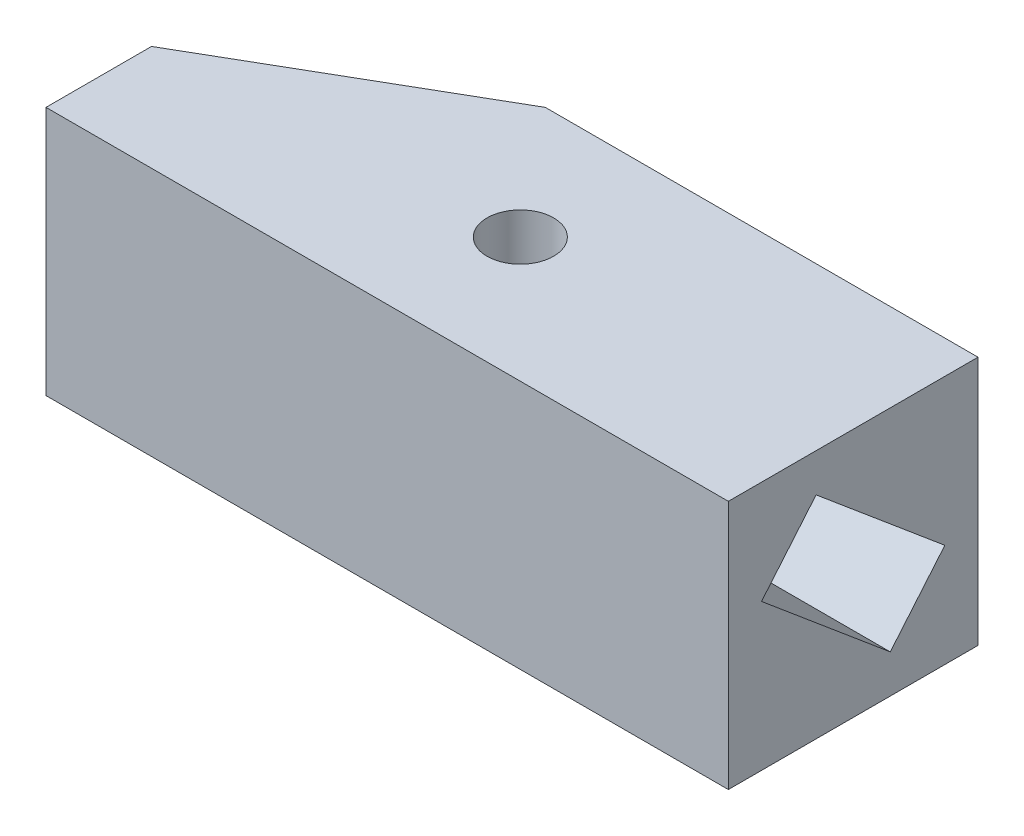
ISO-10303-21;
HEADER;
FILE_DESCRIPTION(('STEP AP214'),'2;1');
FILE_NAME('part.step','',(''),(''),'','','');
FILE_SCHEMA(('AUTOMOTIVE_DESIGN { 1 0 10303 214 1 1 1 1 }'));
ENDSEC;
DATA;
#1=APPLICATION_CONTEXT('core data for automotive mechanical design processes');
#2=APPLICATION_PROTOCOL_DEFINITION('international standard','automotive_design',2000,#1);
#3=PRODUCT_CONTEXT('',#1,'mechanical');
#4=PRODUCT('Part','Part','',(#3));
#5=PRODUCT_RELATED_PRODUCT_CATEGORY('part','',(#4));
#6=PRODUCT_DEFINITION_FORMATION('','',#4);
#7=PRODUCT_DEFINITION_CONTEXT('part definition',#1,'design');
#8=PRODUCT_DEFINITION('design','',#6,#7);
#9=PRODUCT_DEFINITION_SHAPE('','',#8);
#10=(LENGTH_UNIT() NAMED_UNIT(*) SI_UNIT(.MILLI.,.METRE.));
#11=(NAMED_UNIT(*) PLANE_ANGLE_UNIT() SI_UNIT($,.RADIAN.));
#12=(NAMED_UNIT(*) SI_UNIT($,.STERADIAN.) SOLID_ANGLE_UNIT());
#13=UNCERTAINTY_MEASURE_WITH_UNIT(LENGTH_MEASURE(1.E-05),#10,'distance_accuracy_value','');
#14=(GEOMETRIC_REPRESENTATION_CONTEXT(3) GLOBAL_UNCERTAINTY_ASSIGNED_CONTEXT((#13)) GLOBAL_UNIT_ASSIGNED_CONTEXT((#10,
#11,#12)) REPRESENTATION_CONTEXT('',''));
#15=CARTESIAN_POINT('',(0.,0.,0.));
#16=DIRECTION('',(0.,0.,1.));
#17=DIRECTION('',(1.,0.,0.));
#18=AXIS2_PLACEMENT_3D('',#15,#16,#17);
#19=CARTESIAN_POINT('',(20.,30.,15.));
#20=DIRECTION('',(-1.,0.,0.));
#21=DIRECTION('',(0.,0.,1.));
#22=AXIS2_PLACEMENT_3D('',#19,#20,#21);
#23=PLANE('',#22);
#24=DIRECTION('',(0.,-0.766044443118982,0.642787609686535));
#25=VECTOR('',#24,1.);
#26=CARTESIAN_POINT('',(20.,17.5853281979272,11.015265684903));
#27=LINE('',#26,#25);
#28=CARTESIAN_POINT('',(20.,25.3989815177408,4.45883206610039));
#29=VERTEX_POINT('',#28);
#30=CARTESIAN_POINT('',(20.,17.5853281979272,11.015265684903));
#31=VERTEX_POINT('',#30);
#32=EDGE_CURVE('E145',#29,#31,#27,.T.);
#33=ORIENTED_EDGE('',*,*,#32,.F.);
#34=DIRECTION('',(0.,0.642787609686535,0.766044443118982));
#35=VECTOR('',#34,1.);
#36=CARTESIAN_POINT('',(20.,12.4146718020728,-11.015265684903));
#37=LINE('',#36,#35);
#38=CARTESIAN_POINT('',(20.,12.4146718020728,-11.015265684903));
#39=VERTEX_POINT('',#38);
#40=EDGE_CURVE('E129',#39,#29,#37,.T.);
#41=ORIENTED_EDGE('',*,*,#40,.F.);
#42=DIRECTION('',(0.,0.766044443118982,-0.642787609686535));
#43=VECTOR('',#42,1.);
#44=CARTESIAN_POINT('',(20.,4.60101848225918,-4.45883206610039));
#45=LINE('',#44,#43);
#46=CARTESIAN_POINT('',(20.,4.60101848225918,-4.45883206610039));
#47=VERTEX_POINT('',#46);
#48=EDGE_CURVE('E134',#47,#39,#45,.T.);
#49=ORIENTED_EDGE('',*,*,#48,.F.);
#50=DIRECTION('',(0.,-0.642787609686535,-0.766044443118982));
#51=VECTOR('',#50,1.);
#52=CARTESIAN_POINT('',(20.,4.60101848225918,-4.45883206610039));
#53=LINE('',#52,#51);
#54=EDGE_CURVE('E148',#31,#47,#53,.T.);
#55=ORIENTED_EDGE('',*,*,#54,.F.);
#56=EDGE_LOOP('',(#33,#41,#49,#55));
#57=FACE_BOUND('',#56,.T.);
#58=DIRECTION('',(0.,0.,-1.));
#59=VECTOR('',#58,1.);
#60=CARTESIAN_POINT('',(20.,0.,15.));
#61=LINE('',#60,#59);
#62=CARTESIAN_POINT('',(20.,0.,15.));
#63=VERTEX_POINT('',#62);
#64=CARTESIAN_POINT('',(20.,0.,-15.));
#65=VERTEX_POINT('',#64);
#66=EDGE_CURVE('E165',#63,#65,#61,.T.);
#67=ORIENTED_EDGE('',*,*,#66,.T.);
#68=DIRECTION('',(0.,-1.,0.));
#69=VECTOR('',#68,1.);
#70=CARTESIAN_POINT('',(20.,30.,-15.));
#71=LINE('',#70,#69);
#72=CARTESIAN_POINT('',(20.,30.,-15.));
#73=VERTEX_POINT('',#72);
#74=EDGE_CURVE('E178',#73,#65,#71,.T.);
#75=ORIENTED_EDGE('',*,*,#74,.F.);
#76=DIRECTION('',(0.,0.,-1.));
#77=VECTOR('',#76,1.);
#78=CARTESIAN_POINT('',(20.,30.,15.));
#79=LINE('',#78,#77);
#80=CARTESIAN_POINT('',(20.,30.,15.));
#81=VERTEX_POINT('',#80);
#82=EDGE_CURVE('E168',#81,#73,#79,.T.);
#83=ORIENTED_EDGE('',*,*,#82,.F.);
#84=DIRECTION('',(0.,-1.,0.));
#85=VECTOR('',#84,1.);
#86=CARTESIAN_POINT('',(20.,30.,15.));
#87=LINE('',#86,#85);
#88=EDGE_CURVE('E109',#81,#63,#87,.T.);
#89=ORIENTED_EDGE('',*,*,#88,.T.);
#90=EDGE_LOOP('',(#67,#75,#83,#89));
#91=FACE_BOUND('',#90,.T.);
#92=ADVANCED_FACE('F34',(#57,#91),#23,.F.);
#93=CARTESIAN_POINT('',(-35.,30.,-15.));
#94=DIRECTION('',(0.,0.,1.));
#95=DIRECTION('',(1.,0.,0.));
#96=AXIS2_PLACEMENT_3D('',#93,#94,#95);
#97=PLANE('',#96);
#98=DIRECTION('',(-1.,0.,0.));
#99=VECTOR('',#98,1.);
#100=CARTESIAN_POINT('',(-35.,0.,-15.));
#101=LINE('',#100,#99);
#102=CARTESIAN_POINT('',(-31.9999999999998,0.,-15.));
#103=VERTEX_POINT('',#102);
#104=EDGE_CURVE('E174',#65,#103,#101,.T.);
#105=ORIENTED_EDGE('',*,*,#104,.T.);
#106=DIRECTION('',(0.,1.,0.));
#107=VECTOR('',#106,1.);
#108=CARTESIAN_POINT('',(-31.9999999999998,30.,-15.));
#109=LINE('',#108,#107);
#110=CARTESIAN_POINT('',(-31.9999999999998,30.,-15.));
#111=VERTEX_POINT('',#110);
#112=EDGE_CURVE('E42',#103,#111,#109,.T.);
#113=ORIENTED_EDGE('',*,*,#112,.T.);
#114=DIRECTION('',(-1.,0.,0.));
#115=VECTOR('',#114,1.);
#116=CARTESIAN_POINT('',(-20.,30.,-15.));
#117=LINE('',#116,#115);
#118=EDGE_CURVE('E113',#73,#111,#117,.T.);
#119=ORIENTED_EDGE('',*,*,#118,.F.);
#120=ORIENTED_EDGE('',*,*,#74,.T.);
#121=EDGE_LOOP('',(#105,#113,#119,#120));
#122=FACE_BOUND('',#121,.T.);
#123=ADVANCED_FACE('F195',(#122),#97,.F.);
#124=CARTESIAN_POINT('',(-20.,30.,15.));
#125=DIRECTION('',(0.,0.,-1.));
#126=DIRECTION('',(-1.,0.,0.));
#127=AXIS2_PLACEMENT_3D('',#124,#125,#126);
#128=PLANE('',#127);
#129=DIRECTION('',(1.,0.,0.));
#130=VECTOR('',#129,1.);
#131=CARTESIAN_POINT('',(-20.,0.,15.));
#132=LINE('',#131,#130);
#133=CARTESIAN_POINT('',(-62.,0.,15.));
#134=VERTEX_POINT('',#133);
#135=EDGE_CURVE('E170',#134,#63,#132,.T.);
#136=ORIENTED_EDGE('',*,*,#135,.T.);
#137=ORIENTED_EDGE('',*,*,#88,.F.);
#138=DIRECTION('',(1.,0.,0.));
#139=VECTOR('',#138,1.);
#140=CARTESIAN_POINT('',(-20.,30.,15.));
#141=LINE('',#140,#139);
#142=CARTESIAN_POINT('',(-62.,30.,15.));
#143=VERTEX_POINT('',#142);
#144=EDGE_CURVE('E103',#143,#81,#141,.T.);
#145=ORIENTED_EDGE('',*,*,#144,.F.);
#146=DIRECTION('',(0.,1.,0.));
#147=VECTOR('',#146,1.);
#148=CARTESIAN_POINT('',(-62.,0.,15.));
#149=LINE('',#148,#147);
#150=EDGE_CURVE('E107',#134,#143,#149,.T.);
#151=ORIENTED_EDGE('',*,*,#150,.F.);
#152=EDGE_LOOP('',(#136,#137,#145,#151));
#153=FACE_BOUND('',#152,.T.);
#154=ADVANCED_FACE('F105',(#153),#128,.F.);
#155=CARTESIAN_POINT('',(0.,30.,0.));
#156=DIRECTION('',(0.,-1.,0.));
#157=DIRECTION('',(0.,0.,-1.));
#158=AXIS2_PLACEMENT_3D('',#155,#156,#157);
#159=PLANE('',#158);
#160=CARTESIAN_POINT('',(-20.,30.,0.));
#161=DIRECTION('',(0.,1.,0.));
#162=DIRECTION('',(0.,0.,1.));
#163=AXIS2_PLACEMENT_3D('',#160,#161,#162);
#164=CIRCLE('',#163,4.);
#165=CARTESIAN_POINT('',(-20.,30.,4.));
#166=VERTEX_POINT('',#165);
#167=EDGE_CURVE('E155',#166,#166,#164,.T.);
#168=ORIENTED_EDGE('',*,*,#167,.F.);
#169=EDGE_LOOP('',(#168));
#170=FACE_BOUND('',#169,.T.);
#171=ORIENTED_EDGE('',*,*,#118,.T.);
#172=DIRECTION('',(0.86602540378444,0.,-0.499999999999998));
#173=VECTOR('',#172,1.);
#174=CARTESIAN_POINT('',(-62.,30.,2.3205080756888));
#175=LINE('',#174,#173);
#176=CARTESIAN_POINT('',(-62.,30.,2.32050807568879));
#177=VERTEX_POINT('',#176);
#178=EDGE_CURVE('E11',#111,#177,#175,.F.);
#179=ORIENTED_EDGE('',*,*,#178,.T.);
#180=DIRECTION('',(0.,0.,-1.));
#181=VECTOR('',#180,1.);
#182=CARTESIAN_POINT('',(-62.,30.,-15.));
#183=LINE('',#182,#181);
#184=EDGE_CURVE('E116',#143,#177,#183,.T.);
#185=ORIENTED_EDGE('',*,*,#184,.F.);
#186=ORIENTED_EDGE('',*,*,#144,.T.);
#187=ORIENTED_EDGE('',*,*,#82,.T.);
#188=EDGE_LOOP('',(#171,#179,#185,#186,#187));
#189=FACE_BOUND('',#188,.T.);
#190=ADVANCED_FACE('F117',(#170,#189),#159,.F.);
#191=CARTESIAN_POINT('',(0.,0.,0.));
#192=DIRECTION('',(0.,-1.,0.));
#193=DIRECTION('',(0.,0.,-1.));
#194=AXIS2_PLACEMENT_3D('',#191,#192,#193);
#195=PLANE('',#194);
#196=CARTESIAN_POINT('',(-20.,0.,0.));
#197=DIRECTION('',(0.,1.,0.));
#198=DIRECTION('',(0.,0.,1.));
#199=AXIS2_PLACEMENT_3D('',#196,#197,#198);
#200=CIRCLE('',#199,4.);
#201=CARTESIAN_POINT('',(-20.,0.,4.));
#202=VERTEX_POINT('',#201);
#203=EDGE_CURVE('E162',#202,#202,#200,.T.);
#204=ORIENTED_EDGE('',*,*,#203,.T.);
#205=EDGE_LOOP('',(#204));
#206=FACE_BOUND('',#205,.T.);
#207=DIRECTION('',(0.,0.,1.));
#208=VECTOR('',#207,1.);
#209=CARTESIAN_POINT('',(-62.,0.,-15.));
#210=LINE('',#209,#208);
#211=CARTESIAN_POINT('',(-62.,0.,2.32050807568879));
#212=VERTEX_POINT('',#211);
#213=EDGE_CURVE('E122',#212,#134,#210,.T.);
#214=ORIENTED_EDGE('',*,*,#213,.F.);
#215=DIRECTION('',(-0.86602540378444,0.,0.499999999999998));
#216=VECTOR('',#215,1.);
#217=CARTESIAN_POINT('',(-14.4951905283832,0.,-25.1064064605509));
#218=LINE('',#217,#216);
#219=EDGE_CURVE('E56',#212,#103,#218,.F.);
#220=ORIENTED_EDGE('',*,*,#219,.T.);
#221=ORIENTED_EDGE('',*,*,#104,.F.);
#222=ORIENTED_EDGE('',*,*,#66,.F.);
#223=ORIENTED_EDGE('',*,*,#135,.F.);
#224=EDGE_LOOP('',(#214,#220,#221,#222,#223));
#225=FACE_BOUND('',#224,.T.);
#226=ADVANCED_FACE('F184',(#206,#225),#195,.T.);
#227=CARTESIAN_POINT('',(-20.,0.,0.));
#228=DIRECTION('',(0.,1.,0.));
#229=DIRECTION('',(0.,0.,1.));
#230=AXIS2_PLACEMENT_3D('',#227,#228,#229);
#231=CYLINDRICAL_SURFACE('',#230,4.);
#232=ORIENTED_EDGE('',*,*,#203,.F.);
#233=EDGE_LOOP('',(#232));
#234=FACE_BOUND('',#233,.T.);
#235=ORIENTED_EDGE('',*,*,#167,.T.);
#236=EDGE_LOOP('',(#235));
#237=FACE_BOUND('',#236,.T.);
#238=ADVANCED_FACE('F207',(#234,#237),#231,.F.);
#239=CARTESIAN_POINT('',(-5.,12.4146718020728,-11.015265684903));
#240=DIRECTION('',(0.,0.766044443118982,-0.642787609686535));
#241=DIRECTION('',(0.,0.642787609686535,0.766044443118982));
#242=AXIS2_PLACEMENT_3D('',#239,#240,#241);
#243=PLANE('',#242);
#244=ORIENTED_EDGE('',*,*,#40,.T.);
#245=DIRECTION('',(1.,0.,0.));
#246=VECTOR('',#245,1.);
#247=CARTESIAN_POINT('',(-5.,25.3989815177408,4.45883206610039));
#248=LINE('',#247,#246);
#249=CARTESIAN_POINT('',(-5.,25.3989815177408,4.45883206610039));
#250=VERTEX_POINT('',#249);
#251=EDGE_CURVE('E143',#250,#29,#248,.T.);
#252=ORIENTED_EDGE('',*,*,#251,.F.);
#253=DIRECTION('',(0.,0.642787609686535,0.766044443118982));
#254=VECTOR('',#253,1.);
#255=CARTESIAN_POINT('',(-5.,12.4146718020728,-11.015265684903));
#256=LINE('',#255,#254);
#257=CARTESIAN_POINT('',(-5.,12.4146718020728,-11.015265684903));
#258=VERTEX_POINT('',#257);
#259=EDGE_CURVE('E130',#258,#250,#256,.T.);
#260=ORIENTED_EDGE('',*,*,#259,.F.);
#261=DIRECTION('',(1.,0.,0.));
#262=VECTOR('',#261,1.);
#263=CARTESIAN_POINT('',(-5.,12.4146718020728,-11.015265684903));
#264=LINE('',#263,#262);
#265=EDGE_CURVE('E153',#258,#39,#264,.T.);
#266=ORIENTED_EDGE('',*,*,#265,.T.);
#267=EDGE_LOOP('',(#244,#252,#260,#266));
#268=FACE_BOUND('',#267,.T.);
#269=ADVANCED_FACE('F214',(#268),#243,.F.);
#270=CARTESIAN_POINT('',(-5.,4.60101848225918,-4.45883206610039));
#271=DIRECTION('',(0.,-0.642787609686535,-0.766044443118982));
#272=DIRECTION('',(0.,0.766044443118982,-0.642787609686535));
#273=AXIS2_PLACEMENT_3D('',#270,#271,#272);
#274=PLANE('',#273);
#275=ORIENTED_EDGE('',*,*,#48,.T.);
#276=ORIENTED_EDGE('',*,*,#265,.F.);
#277=DIRECTION('',(0.,0.766044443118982,-0.642787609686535));
#278=VECTOR('',#277,1.);
#279=CARTESIAN_POINT('',(-5.,4.60101848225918,-4.45883206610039));
#280=LINE('',#279,#278);
#281=CARTESIAN_POINT('',(-5.,4.60101848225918,-4.45883206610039));
#282=VERTEX_POINT('',#281);
#283=EDGE_CURVE('E140',#282,#258,#280,.T.);
#284=ORIENTED_EDGE('',*,*,#283,.F.);
#285=DIRECTION('',(1.,0.,0.));
#286=VECTOR('',#285,1.);
#287=CARTESIAN_POINT('',(-5.,4.60101848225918,-4.45883206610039));
#288=LINE('',#287,#286);
#289=EDGE_CURVE('E156',#282,#47,#288,.T.);
#290=ORIENTED_EDGE('',*,*,#289,.T.);
#291=EDGE_LOOP('',(#275,#276,#284,#290));
#292=FACE_BOUND('',#291,.T.);
#293=ADVANCED_FACE('F218',(#292),#274,.F.);
#294=CARTESIAN_POINT('',(-5.,4.60101848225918,-4.45883206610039));
#295=DIRECTION('',(0.,-0.766044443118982,0.642787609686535));
#296=DIRECTION('',(0.,-0.642787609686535,-0.766044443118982));
#297=AXIS2_PLACEMENT_3D('',#294,#295,#296);
#298=PLANE('',#297);
#299=ORIENTED_EDGE('',*,*,#54,.T.);
#300=ORIENTED_EDGE('',*,*,#289,.F.);
#301=DIRECTION('',(0.,-0.642787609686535,-0.766044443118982));
#302=VECTOR('',#301,1.);
#303=CARTESIAN_POINT('',(-5.,4.60101848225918,-4.45883206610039));
#304=LINE('',#303,#302);
#305=CARTESIAN_POINT('',(-5.,17.5853281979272,11.015265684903));
#306=VERTEX_POINT('',#305);
#307=EDGE_CURVE('E137',#306,#282,#304,.T.);
#308=ORIENTED_EDGE('',*,*,#307,.F.);
#309=DIRECTION('',(1.,0.,0.));
#310=VECTOR('',#309,1.);
#311=CARTESIAN_POINT('',(-5.,17.5853281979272,11.015265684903));
#312=LINE('',#311,#310);
#313=EDGE_CURVE('E158',#306,#31,#312,.T.);
#314=ORIENTED_EDGE('',*,*,#313,.T.);
#315=EDGE_LOOP('',(#299,#300,#308,#314));
#316=FACE_BOUND('',#315,.T.);
#317=ADVANCED_FACE('F223',(#316),#298,.F.);
#318=CARTESIAN_POINT('',(-5.,17.5853281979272,11.015265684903));
#319=DIRECTION('',(0.,0.642787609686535,0.766044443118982));
#320=DIRECTION('',(0.,-0.766044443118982,0.642787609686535));
#321=AXIS2_PLACEMENT_3D('',#318,#319,#320);
#322=PLANE('',#321);
#323=ORIENTED_EDGE('',*,*,#32,.T.);
#324=ORIENTED_EDGE('',*,*,#313,.F.);
#325=DIRECTION('',(0.,-0.766044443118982,0.642787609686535));
#326=VECTOR('',#325,1.);
#327=CARTESIAN_POINT('',(-5.,17.5853281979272,11.015265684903));
#328=LINE('',#327,#326);
#329=EDGE_CURVE('E133',#250,#306,#328,.T.);
#330=ORIENTED_EDGE('',*,*,#329,.F.);
#331=ORIENTED_EDGE('',*,*,#251,.T.);
#332=EDGE_LOOP('',(#323,#324,#330,#331));
#333=FACE_BOUND('',#332,.T.);
#334=ADVANCED_FACE('F220',(#333),#322,.F.);
#335=CARTESIAN_POINT('',(-5.,0.,0.));
#336=DIRECTION('',(-1.,0.,0.));
#337=DIRECTION('',(0.,0.,1.));
#338=AXIS2_PLACEMENT_3D('',#335,#336,#337);
#339=PLANE('',#338);
#340=ORIENTED_EDGE('',*,*,#259,.T.);
#341=ORIENTED_EDGE('',*,*,#329,.T.);
#342=ORIENTED_EDGE('',*,*,#307,.T.);
#343=ORIENTED_EDGE('',*,*,#283,.T.);
#344=EDGE_LOOP('',(#340,#341,#342,#343));
#345=FACE_BOUND('',#344,.T.);
#346=ADVANCED_FACE('F192',(#345),#339,.F.);
#347=CARTESIAN_POINT('',(-62.,0.,0.));
#348=DIRECTION('',(1.,0.,0.));
#349=DIRECTION('',(0.,0.,-1.));
#350=AXIS2_PLACEMENT_3D('',#347,#348,#349);
#351=PLANE('',#350);
#352=ORIENTED_EDGE('',*,*,#184,.T.);
#353=DIRECTION('',(0.,-1.,0.));
#354=VECTOR('',#353,1.);
#355=CARTESIAN_POINT('',(-62.,0.,2.3205080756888));
#356=LINE('',#355,#354);
#357=EDGE_CURVE('E181',#177,#212,#356,.T.);
#358=ORIENTED_EDGE('',*,*,#357,.T.);
#359=ORIENTED_EDGE('',*,*,#213,.T.);
#360=ORIENTED_EDGE('',*,*,#150,.T.);
#361=EDGE_LOOP('',(#352,#358,#359,#360));
#362=FACE_BOUND('',#361,.T.);
#363=ADVANCED_FACE('F124',(#362),#351,.F.);
#364=CARTESIAN_POINT('',(-62.,0.,2.3205080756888));
#365=DIRECTION('',(0.499999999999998,0.,0.86602540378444));
#366=DIRECTION('',(0.,-1.,0.));
#367=AXIS2_PLACEMENT_3D('',#364,#365,#366);
#368=PLANE('',#367);
#369=ORIENTED_EDGE('',*,*,#178,.F.);
#370=ORIENTED_EDGE('',*,*,#112,.F.);
#371=ORIENTED_EDGE('',*,*,#219,.F.);
#372=ORIENTED_EDGE('',*,*,#357,.F.);
#373=EDGE_LOOP('',(#369,#370,#371,#372));
#374=FACE_BOUND('',#373,.T.);
#375=ADVANCED_FACE('F36',(#374),#368,.F.);
#376=CLOSED_SHELL('',(#92,#123,#154,#190,#226,#238,#269,#293,#317,#334,#346,#363,#375));
#377=MANIFOLD_SOLID_BREP('B2',#376);
#378=ADVANCED_BREP_SHAPE_REPRESENTATION('',(#18,#377),#14);
#379=SHAPE_DEFINITION_REPRESENTATION(#9,#378);
ENDSEC;
END-ISO-10303-21;
